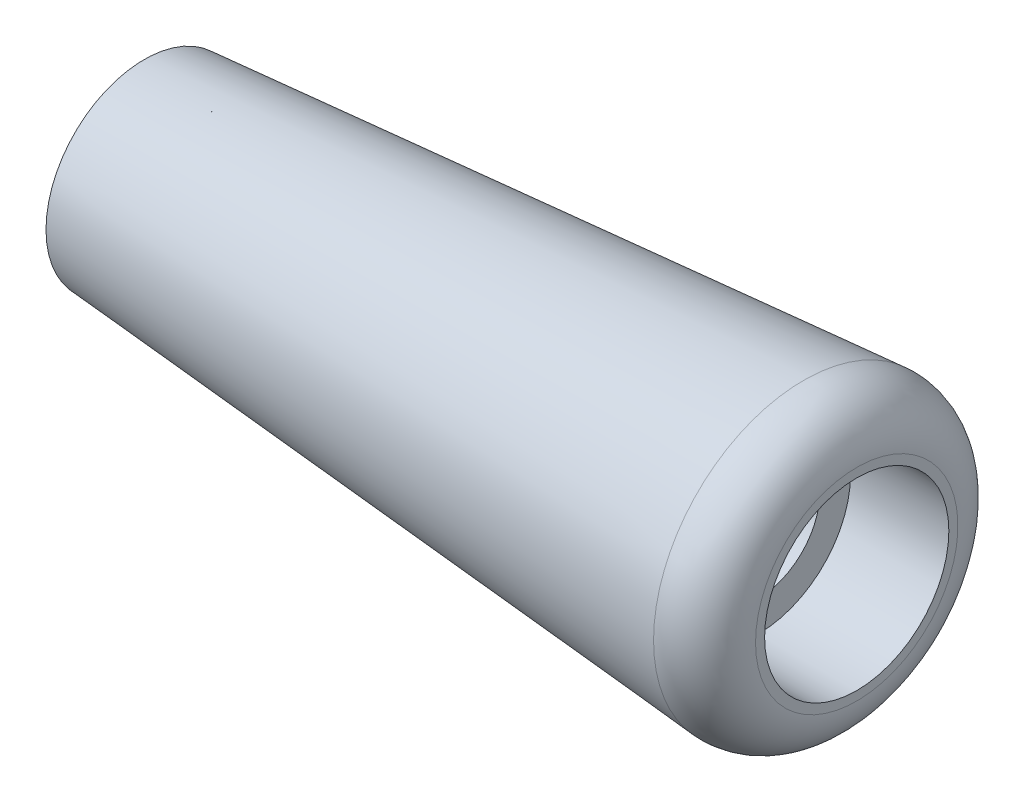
ISO-10303-21;
HEADER;
FILE_DESCRIPTION(('STEP AP214'),'2;1');
FILE_NAME('part.step','',(''),(''),'','','');
FILE_SCHEMA(('AUTOMOTIVE_DESIGN { 1 0 10303 214 1 1 1 1 }'));
ENDSEC;
DATA;
#1=APPLICATION_CONTEXT('core data for automotive mechanical design processes');
#2=APPLICATION_PROTOCOL_DEFINITION('international standard','automotive_design',2000,#1);
#3=PRODUCT_CONTEXT('',#1,'mechanical');
#4=PRODUCT('Part','Part','',(#3));
#5=PRODUCT_RELATED_PRODUCT_CATEGORY('part','',(#4));
#6=PRODUCT_DEFINITION_FORMATION('','',#4);
#7=PRODUCT_DEFINITION_CONTEXT('part definition',#1,'design');
#8=PRODUCT_DEFINITION('design','',#6,#7);
#9=PRODUCT_DEFINITION_SHAPE('','',#8);
#10=(LENGTH_UNIT() NAMED_UNIT(*) SI_UNIT(.MILLI.,.METRE.));
#11=(NAMED_UNIT(*) PLANE_ANGLE_UNIT() SI_UNIT($,.RADIAN.));
#12=(NAMED_UNIT(*) SI_UNIT($,.STERADIAN.) SOLID_ANGLE_UNIT());
#13=UNCERTAINTY_MEASURE_WITH_UNIT(LENGTH_MEASURE(1.E-05),#10,'distance_accuracy_value','');
#14=(GEOMETRIC_REPRESENTATION_CONTEXT(3) GLOBAL_UNCERTAINTY_ASSIGNED_CONTEXT((#13)) GLOBAL_UNIT_ASSIGNED_CONTEXT((#10,
#11,#12)) REPRESENTATION_CONTEXT('',''));
#15=CARTESIAN_POINT('',(0.,0.,0.));
#16=DIRECTION('',(0.,0.,1.));
#17=DIRECTION('',(1.,0.,0.));
#18=AXIS2_PLACEMENT_3D('',#15,#16,#17);
#19=CARTESIAN_POINT('',(13.5090523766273,0.,0.));
#20=DIRECTION('',(1.,0.,0.));
#21=DIRECTION('',(0.,0.,-0.999999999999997));
#22=AXIS2_PLACEMENT_3D('',#19,#20,#21);
#23=CONICAL_SURFACE('',#22,12.5646989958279,0.0785398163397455);
#24=CARTESIAN_POINT('',(9.19521599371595,0.,0.));
#25=DIRECTION('',(-1.,0.,0.));
#26=DIRECTION('',(0.,0.,0.999999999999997));
#27=AXIS2_PLACEMENT_3D('',#24,#25,#26);
#28=CIRCLE('',#27,12.2251927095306);
#29=CARTESIAN_POINT('',(9.19521599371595,0.,12.2251927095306));
#30=VERTEX_POINT('',#29);
#31=EDGE_CURVE('E46',#30,#30,#28,.T.);
#32=ORIENTED_EDGE('',*,*,#31,.T.);
#33=EDGE_LOOP('',(#32));
#34=FACE_BOUND('',#33,.T.);
#35=CARTESIAN_POINT('',(-44.4909476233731,0.,0.));
#36=DIRECTION('',(-1.,0.,0.));
#37=DIRECTION('',(0.,0.,0.999999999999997));
#38=AXIS2_PLACEMENT_3D('',#35,#36,#37);
#39=CIRCLE('',#38,8.);
#40=CARTESIAN_POINT('',(-44.4909476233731,0.,7.99999999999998));
#41=VERTEX_POINT('',#40);
#42=EDGE_CURVE('E60',#41,#41,#39,.T.);
#43=ORIENTED_EDGE('',*,*,#42,.F.);
#44=EDGE_LOOP('',(#43));
#45=FACE_BOUND('',#44,.T.);
#46=ADVANCED_FACE('F32',(#34,#45),#23,.T.);
#47=CARTESIAN_POINT('',(13.5090523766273,12.5646989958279,-4.44089209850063E-13));
#48=DIRECTION('',(-1.,0.,0.));
#49=DIRECTION('',(0.,0.,0.999999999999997));
#50=AXIS2_PLACEMENT_3D('',#47,#48,#49);
#51=PLANE('',#50);
#52=CARTESIAN_POINT('',(13.5090523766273,0.,0.));
#53=DIRECTION('',(-1.,0.,0.));
#54=DIRECTION('',(0.,0.,0.999999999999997));
#55=AXIS2_PLACEMENT_3D('',#52,#53,#54);
#56=CIRCLE('',#55,8.23752337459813);
#57=CARTESIAN_POINT('',(13.5090523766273,0.,8.23752337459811));
#58=VERTEX_POINT('',#57);
#59=EDGE_CURVE('E42',#58,#58,#56,.F.);
#60=ORIENTED_EDGE('',*,*,#59,.T.);
#61=EDGE_LOOP('',(#60));
#62=FACE_BOUND('',#61,.T.);
#63=CARTESIAN_POINT('',(13.5090523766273,0.,0.));
#64=DIRECTION('',(-1.,0.,0.));
#65=DIRECTION('',(0.,0.,0.999999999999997));
#66=AXIS2_PLACEMENT_3D('',#63,#64,#65);
#67=CIRCLE('',#66,7.5);
#68=CARTESIAN_POINT('',(13.5090523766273,0.,7.49999999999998));
#69=VERTEX_POINT('',#68);
#70=EDGE_CURVE('E51',#69,#69,#67,.T.);
#71=ORIENTED_EDGE('',*,*,#70,.T.);
#72=EDGE_LOOP('',(#71));
#73=FACE_BOUND('',#72,.T.);
#74=ADVANCED_FACE('F67',(#62,#73),#51,.F.);
#75=CARTESIAN_POINT('',(-59.8116257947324,0.,0.));
#76=DIRECTION('',(-1.,0.,0.));
#77=DIRECTION('',(0.,0.,0.999999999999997));
#78=AXIS2_PLACEMENT_3D('',#75,#76,#77);
#79=CYLINDRICAL_SURFACE('',#78,7.5);
#80=ORIENTED_EDGE('',*,*,#70,.F.);
#81=EDGE_LOOP('',(#80));
#82=FACE_BOUND('',#81,.T.);
#83=CARTESIAN_POINT('',(5.50905237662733,0.,0.));
#84=DIRECTION('',(-1.,0.,0.));
#85=DIRECTION('',(0.,0.,0.999999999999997));
#86=AXIS2_PLACEMENT_3D('',#83,#84,#85);
#87=CIRCLE('',#86,7.5);
#88=CARTESIAN_POINT('',(5.50905237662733,0.,7.49999999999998));
#89=VERTEX_POINT('',#88);
#90=EDGE_CURVE('E54',#89,#89,#87,.T.);
#91=ORIENTED_EDGE('',*,*,#90,.T.);
#92=EDGE_LOOP('',(#91));
#93=FACE_BOUND('',#92,.T.);
#94=ADVANCED_FACE('F72',(#82,#93),#79,.F.);
#95=CARTESIAN_POINT('',(5.50905237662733,7.5,0.));
#96=DIRECTION('',(-1.,0.,0.));
#97=DIRECTION('',(0.,0.,0.999999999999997));
#98=AXIS2_PLACEMENT_3D('',#95,#96,#97);
#99=PLANE('',#98);
#100=ORIENTED_EDGE('',*,*,#90,.F.);
#101=EDGE_LOOP('',(#100));
#102=FACE_BOUND('',#101,.T.);
#103=CARTESIAN_POINT('',(5.50905237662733,0.,0.));
#104=DIRECTION('',(-1.,0.,0.));
#105=DIRECTION('',(0.,0.,0.999999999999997));
#106=AXIS2_PLACEMENT_3D('',#103,#104,#105);
#107=CIRCLE('',#106,5.);
#108=CARTESIAN_POINT('',(5.50905237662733,0.,4.99999999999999));
#109=VERTEX_POINT('',#108);
#110=EDGE_CURVE('E57',#109,#109,#107,.T.);
#111=ORIENTED_EDGE('',*,*,#110,.T.);
#112=EDGE_LOOP('',(#111));
#113=FACE_BOUND('',#112,.T.);
#114=ADVANCED_FACE('F93',(#102,#113),#99,.F.);
#115=CARTESIAN_POINT('',(-59.8116257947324,0.,0.));
#116=DIRECTION('',(-1.,0.,0.));
#117=DIRECTION('',(0.,0.,0.999999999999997));
#118=AXIS2_PLACEMENT_3D('',#115,#116,#117);
#119=CYLINDRICAL_SURFACE('',#118,5.);
#120=CARTESIAN_POINT('',(-43.9909476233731,0.,0.));
#121=DIRECTION('',(1.,0.,0.));
#122=DIRECTION('',(0.,0.,-0.999999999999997));
#123=AXIS2_PLACEMENT_3D('',#120,#121,#122);
#124=CIRCLE('',#123,5.);
#125=CARTESIAN_POINT('',(-43.9909476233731,0.,-4.99999999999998));
#126=VERTEX_POINT('',#125);
#127=EDGE_CURVE('E38',#126,#126,#124,.F.);
#128=ORIENTED_EDGE('',*,*,#127,.T.);
#129=EDGE_LOOP('',(#128));
#130=FACE_BOUND('',#129,.T.);
#131=ORIENTED_EDGE('',*,*,#110,.F.);
#132=EDGE_LOOP('',(#131));
#133=FACE_BOUND('',#132,.T.);
#134=ADVANCED_FACE('F87',(#130,#133),#119,.F.);
#135=CARTESIAN_POINT('',(-44.4909476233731,4.99999999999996,3.05311331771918E-13));
#136=DIRECTION('',(1.,0.,0.));
#137=DIRECTION('',(0.,0.,-0.999999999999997));
#138=AXIS2_PLACEMENT_3D('',#135,#136,#137);
#139=PLANE('',#138);
#140=CARTESIAN_POINT('',(-44.4909476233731,0.,0.));
#141=DIRECTION('',(1.,0.,0.));
#142=DIRECTION('',(0.,0.,-0.999999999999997));
#143=AXIS2_PLACEMENT_3D('',#140,#141,#142);
#144=CIRCLE('',#143,5.49999999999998);
#145=CARTESIAN_POINT('',(-44.4909476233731,0.,-5.49999999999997));
#146=VERTEX_POINT('',#145);
#147=EDGE_CURVE('E10',#146,#146,#144,.T.);
#148=ORIENTED_EDGE('',*,*,#147,.T.);
#149=EDGE_LOOP('',(#148));
#150=FACE_BOUND('',#149,.T.);
#151=ORIENTED_EDGE('',*,*,#42,.T.);
#152=EDGE_LOOP('',(#151));
#153=FACE_BOUND('',#152,.T.);
#154=ADVANCED_FACE('F64',(#150,#153),#139,.F.);
#155=CARTESIAN_POINT('',(9.5090523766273,0.,0.));
#156=DIRECTION('',(-1.,0.,0.));
#157=DIRECTION('',(0.,0.,0.999999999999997));
#158=AXIS2_PLACEMENT_3D('',#155,#156,#157);
#159=TOROIDAL_SURFACE('',#158,8.23752337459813,4.);
#160=ORIENTED_EDGE('',*,*,#59,.F.);
#161=EDGE_LOOP('',(#160));
#162=FACE_BOUND('',#161,.T.);
#163=ORIENTED_EDGE('',*,*,#31,.F.);
#164=EDGE_LOOP('',(#163));
#165=FACE_BOUND('',#164,.T.);
#166=ADVANCED_FACE('F76',(#162,#165),#159,.T.);
#167=CARTESIAN_POINT('',(-43.9909476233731,0.,0.));
#168=DIRECTION('',(-1.,0.,0.));
#169=DIRECTION('',(0.,0.,0.999999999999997));
#170=AXIS2_PLACEMENT_3D('',#167,#168,#169);
#171=CONICAL_SURFACE('',#170,5.,0.785398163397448);
#172=ORIENTED_EDGE('',*,*,#147,.F.);
#173=EDGE_LOOP('',(#172));
#174=FACE_BOUND('',#173,.T.);
#175=ORIENTED_EDGE('',*,*,#127,.F.);
#176=EDGE_LOOP('',(#175));
#177=FACE_BOUND('',#176,.T.);
#178=ADVANCED_FACE('F78',(#174,#177),#171,.F.);
#179=CLOSED_SHELL('',(#46,#74,#94,#114,#134,#154,#166,#178));
#180=MANIFOLD_SOLID_BREP('B2',#179);
#181=ADVANCED_BREP_SHAPE_REPRESENTATION('',(#18,#180),#14);
#182=SHAPE_DEFINITION_REPRESENTATION(#9,#181);
ENDSEC;
END-ISO-10303-21;
